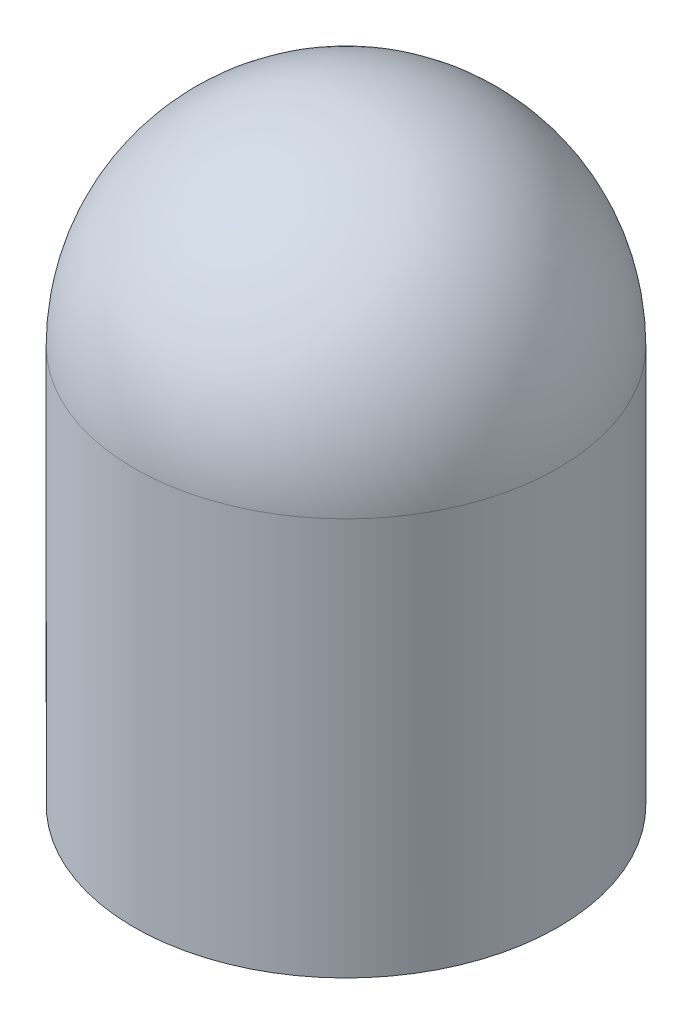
ISO-10303-21;
HEADER;
FILE_DESCRIPTION(('STEP AP214'),'2;1');
FILE_NAME('part.step','',(''),(''),'','','');
FILE_SCHEMA(('AUTOMOTIVE_DESIGN { 1 0 10303 214 1 1 1 1 }'));
ENDSEC;
DATA;
#1=APPLICATION_CONTEXT('core data for automotive mechanical design processes');
#2=APPLICATION_PROTOCOL_DEFINITION('international standard','automotive_design',2000,#1);
#3=PRODUCT_CONTEXT('',#1,'mechanical');
#4=PRODUCT('Part','Part','',(#3));
#5=PRODUCT_RELATED_PRODUCT_CATEGORY('part','',(#4));
#6=PRODUCT_DEFINITION_FORMATION('','',#4);
#7=PRODUCT_DEFINITION_CONTEXT('part definition',#1,'design');
#8=PRODUCT_DEFINITION('design','',#6,#7);
#9=PRODUCT_DEFINITION_SHAPE('','',#8);
#10=(LENGTH_UNIT() NAMED_UNIT(*) SI_UNIT(.MILLI.,.METRE.));
#11=(NAMED_UNIT(*) PLANE_ANGLE_UNIT() SI_UNIT($,.RADIAN.));
#12=(NAMED_UNIT(*) SI_UNIT($,.STERADIAN.) SOLID_ANGLE_UNIT());
#13=UNCERTAINTY_MEASURE_WITH_UNIT(LENGTH_MEASURE(1.E-05),#10,'distance_accuracy_value','');
#14=(GEOMETRIC_REPRESENTATION_CONTEXT(3) GLOBAL_UNCERTAINTY_ASSIGNED_CONTEXT((#13)) GLOBAL_UNIT_ASSIGNED_CONTEXT((#10,
#11,#12)) REPRESENTATION_CONTEXT('',''));
#15=CARTESIAN_POINT('',(0.,0.,0.));
#16=DIRECTION('',(0.,0.,1.));
#17=DIRECTION('',(1.,0.,0.));
#18=AXIS2_PLACEMENT_3D('',#15,#16,#17);
#19=CARTESIAN_POINT('',(0.,0.,0.));
#20=DIRECTION('',(0.,-1.,0.));
#21=DIRECTION('',(-1.,0.,0.));
#22=AXIS2_PLACEMENT_3D('',#19,#20,#21);
#23=SPHERICAL_SURFACE('',#22,62.992);
#24=CARTESIAN_POINT('',(0.,0.,0.));
#25=DIRECTION('',(0.,-1.,0.));
#26=DIRECTION('',(1.,0.,0.));
#27=AXIS2_PLACEMENT_3D('',#24,#25,#26);
#28=CIRCLE('',#27,62.992);
#29=CARTESIAN_POINT('',(62.992,0.,0.));
#30=VERTEX_POINT('',#29);
#31=EDGE_CURVE('E10',#30,#30,#28,.T.);
#32=ORIENTED_EDGE('',*,*,#31,.F.);
#33=EDGE_LOOP('',(#32));
#34=FACE_BOUND('',#33,.T.);
#35=ADVANCED_FACE('F31',(#34),#23,.T.);
#36=CARTESIAN_POINT('',(0.,0.,0.));
#37=DIRECTION('',(0.,-1.,0.));
#38=DIRECTION('',(1.,0.,0.));
#39=AXIS2_PLACEMENT_3D('',#36,#37,#38);
#40=CYLINDRICAL_SURFACE('',#39,62.992);
#41=CARTESIAN_POINT('',(0.,-118.11,0.));
#42=DIRECTION('',(0.,-1.,0.));
#43=DIRECTION('',(1.,0.,0.));
#44=AXIS2_PLACEMENT_3D('',#41,#42,#43);
#45=CIRCLE('',#44,62.992);
#46=CARTESIAN_POINT('',(62.9919999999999,-118.11,0.));
#47=VERTEX_POINT('',#46);
#48=EDGE_CURVE('E37',#47,#47,#45,.T.);
#49=ORIENTED_EDGE('',*,*,#48,.F.);
#50=EDGE_LOOP('',(#49));
#51=FACE_BOUND('',#50,.T.);
#52=ORIENTED_EDGE('',*,*,#31,.T.);
#53=EDGE_LOOP('',(#52));
#54=FACE_BOUND('',#53,.T.);
#55=ADVANCED_FACE('F45',(#51,#54),#40,.T.);
#56=CARTESIAN_POINT('',(-62.992,-118.11,0.));
#57=DIRECTION('',(0.,1.,0.));
#58=DIRECTION('',(-1.,0.,0.));
#59=AXIS2_PLACEMENT_3D('',#56,#57,#58);
#60=PLANE('',#59);
#61=ORIENTED_EDGE('',*,*,#48,.T.);
#62=EDGE_LOOP('',(#61));
#63=FACE_BOUND('',#62,.T.);
#64=ADVANCED_FACE('F43',(#63),#60,.F.);
#65=CLOSED_SHELL('',(#35,#55,#64));
#66=MANIFOLD_SOLID_BREP('B2',#65);
#67=ADVANCED_BREP_SHAPE_REPRESENTATION('',(#18,#66),#14);
#68=SHAPE_DEFINITION_REPRESENTATION(#9,#67);
ENDSEC;
END-ISO-10303-21;
